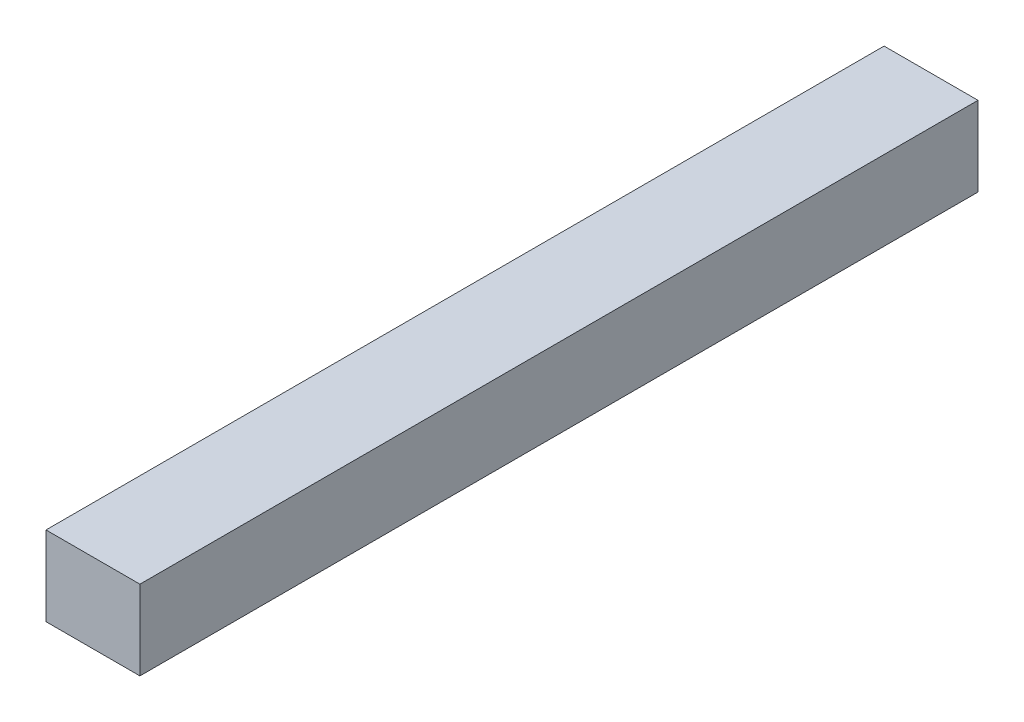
from build123d import *

# Parameters (mm, degrees)
ESQUISSE1_W        = 65
ESQUISSE1_H        = 55
BOSS_EXTRU_1_DEPTH = 580


with BuildPart() as part:
    # Esquisse1 → Boss.-Extru.1 (new body)
    with BuildSketch(Plane.XY):
        Rectangle(ESQUISSE1_W, ESQUISSE1_H)
    extrude(amount=BOSS_EXTRU_1_DEPTH)


solid = part.part
